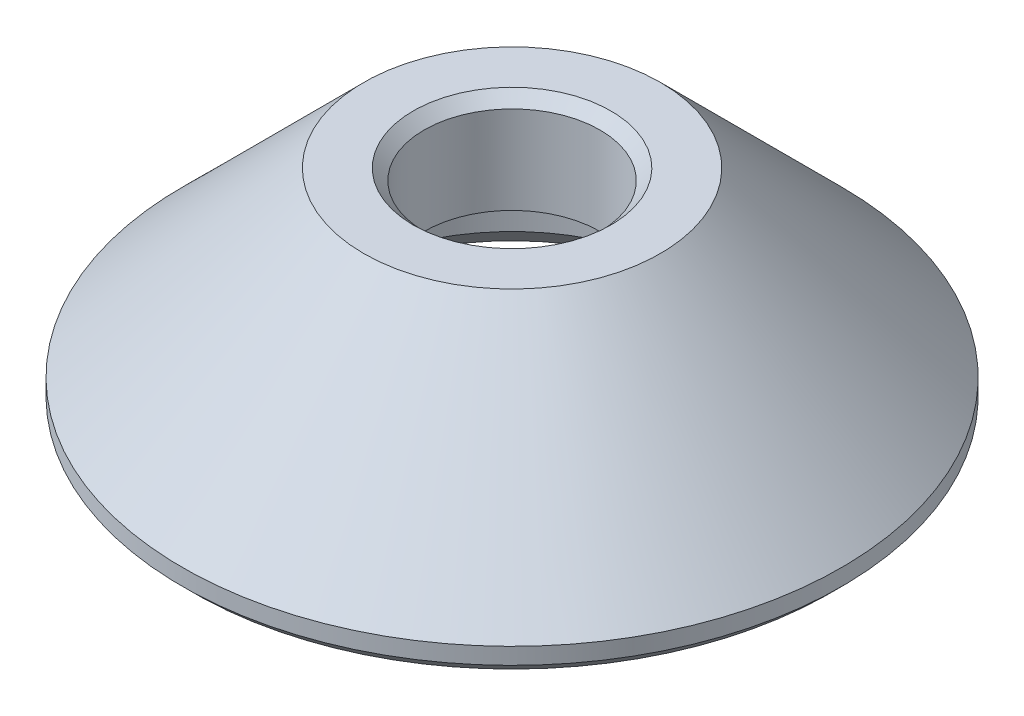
from build123d import *

# Parameters (mm, degrees)
CHAMFER1_SIZE = 0.5
CHAMFER2_SIZE = 0.2


with BuildPart() as part:
    # Sketch1 → Revolve1 (revolve)
    with BuildSketch(Plane.XY, mode=Mode.PRIVATE) as revolve1_sk:
        Polygon((3.25, -0.245226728), (6, -0.245226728), (6, 0.254773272), (2.7, 3.554773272), (1.6, 3.554773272), (1.6, 1.754773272), (3.25, 1.754773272), align=None)
    revolve(revolve1_sk.sketch.rotate(Axis((0, 0, 0), (0, 1, 0)), 90), axis=Axis((0, 0, 0), (0, 1, 0)))

    # Chamfer1
    chamfer1_edges = [part.edges().sort_by_distance(p)[0] for p in [
        (0, -0.245226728, 3.25),
    ]]
    chamfer(chamfer1_edges, length=CHAMFER1_SIZE)

    # Chamfer2
    chamfer2_edges = [part.edges().sort_by_distance(p)[0] for p in [
        (0, 3.554773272, 1.6),
        (0, -0.245226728, 6),
    ]]
    chamfer(chamfer2_edges, length=CHAMFER2_SIZE)


solid = part.part
